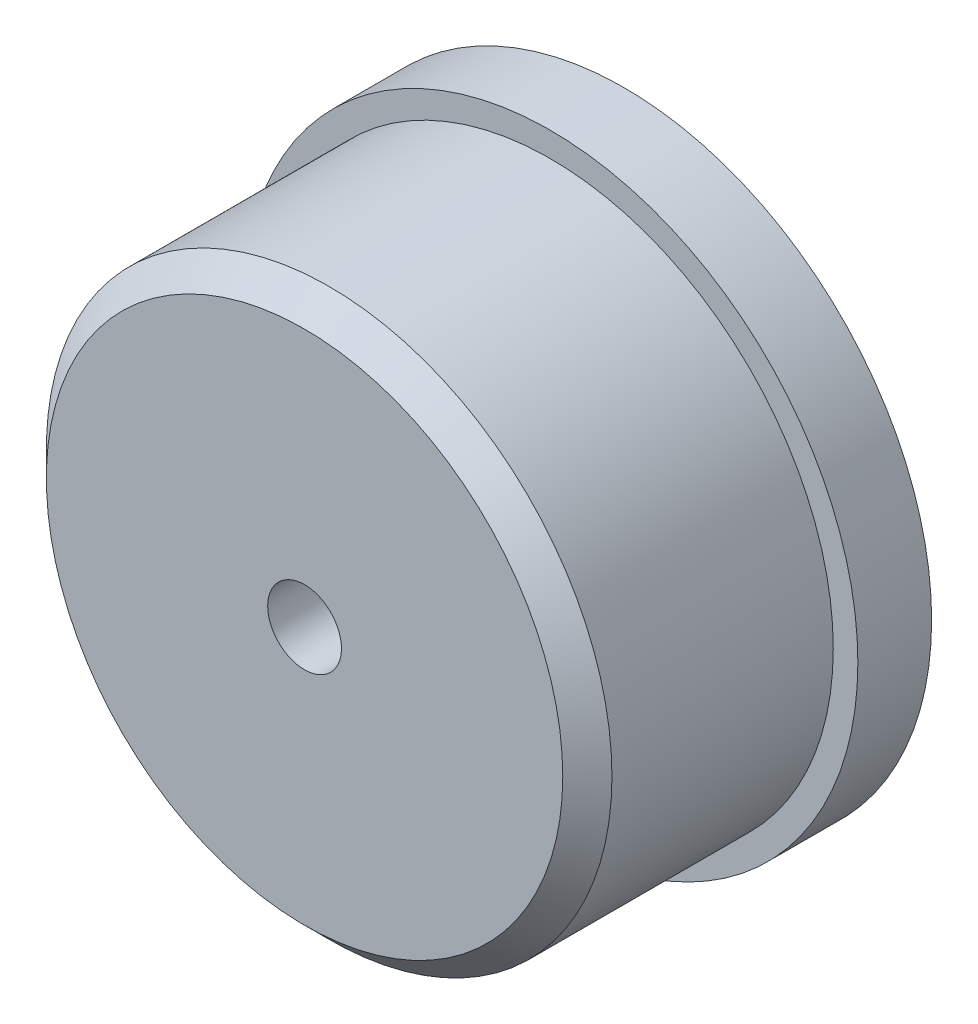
from build123d import *

# Parameters (mm, degrees)
ESQUISSE1_R       = 12.5
EXTRUSION1_DEPTH  = 3
ESQUISSE2_R       = 11.5
EXTRUSION2_DEPTH  = 10
CHANFREIN1_SIZE   = 1
TROU_TARAUD_M41_D = 3


with BuildPart() as part:
    # Esquisse1 → Extrusion1 (new body)
    with BuildSketch(Plane.XY):
        Circle(ESQUISSE1_R)
    extrude(amount=EXTRUSION1_DEPTH)

    # Esquisse2 → Extrusion2 (add)
    with BuildSketch(Plane.XY.offset(3)):
        Circle(ESQUISSE2_R)
    extrude(amount=EXTRUSION2_DEPTH)

    # Chanfrein1
    chanfrein1_edges = [part.edges().sort_by_distance(p)[0] for p in [
        (-11.5, 0, 13),
    ]]
    chamfer(chanfrein1_edges, length=CHANFREIN1_SIZE)

    # Trou taraud_ M41 (through all)
    with Locations(Plane(origin=(0, 0, 0), x_dir=(-1, 0, 0), z_dir=(0, 0, -1))):
        with Locations((0, 0)):
            Hole(TROU_TARAUD_M41_D / 2)


solid = part.part
